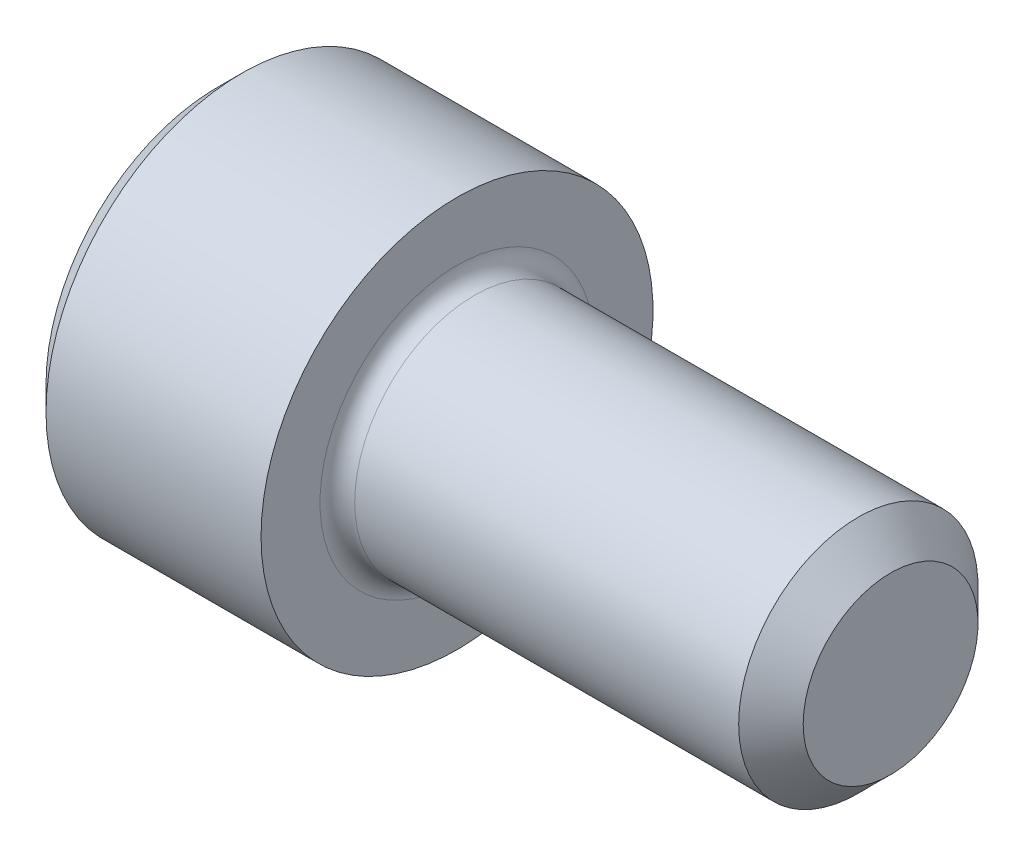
from build123d import *

# Parameters (mm, degrees)
FILLET1_R   = 0.254
HEX_2_DEPTH = 1.6256


with BuildPart() as part:
    # BodySke → Base-Revolve (revolve)
    with BuildSketch(Plane.XY, mode=Mode.PRIVATE) as base_revolve_sk:
        Polygon((0, 0), (0, 2.5146), (0.3556, 2.8702), (3.5052, 2.8702), (3.5052, 1.7526), (9.38276, 1.7526), (9.8552, 1.28016), (9.8552, 0), align=None)
    revolve(base_revolve_sk.sketch.rotate(Axis((-31.75, 0, 0), (1, 0, 0)), 90), axis=Axis((-31.75, 0, 0), (1, 0, 0)))

    # Fillet1
    fillet1_edges = [part.edges().sort_by_distance(p)[0] for p in [
        (3.5052, 0, -1.7526),
    ]]
    fillet(fillet1_edges, radius=FILLET1_R)

    # Sketch2 → Hex-PreBroach (revolve, cut)
    with BuildSketch(Plane.XY, mode=Mode.PRIVATE) as hex_prebroach_sk:
        Polygon((0, 1.3843), (1.6256, 1.3843), (2.424825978, 0), (0, 0), align=None)
    revolve(hex_prebroach_sk.sketch.rotate(Axis((0, 0, 0), (1, 0, 0)), 90), axis=Axis((0, 0, 0), (1, 0, 0)), mode=Mode.SUBTRACT)

    # Sketch3 → Hex 2 (cut)
    with BuildSketch(Plane(origin=(0, 0, 0), x_dir=(0, 0.500000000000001, 0.866025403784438), z_dir=(-1, 0, 0))):
        Polygon((0.799225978, 1.3843), (-0.799225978, 1.3843), (-1.598451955, 0), (-0.799225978, -1.3843), (0.799225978, -1.3843), (1.598451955, 0), align=None)
    extrude(amount=-HEX_2_DEPTH, mode=Mode.SUBTRACT)


solid = part.part
